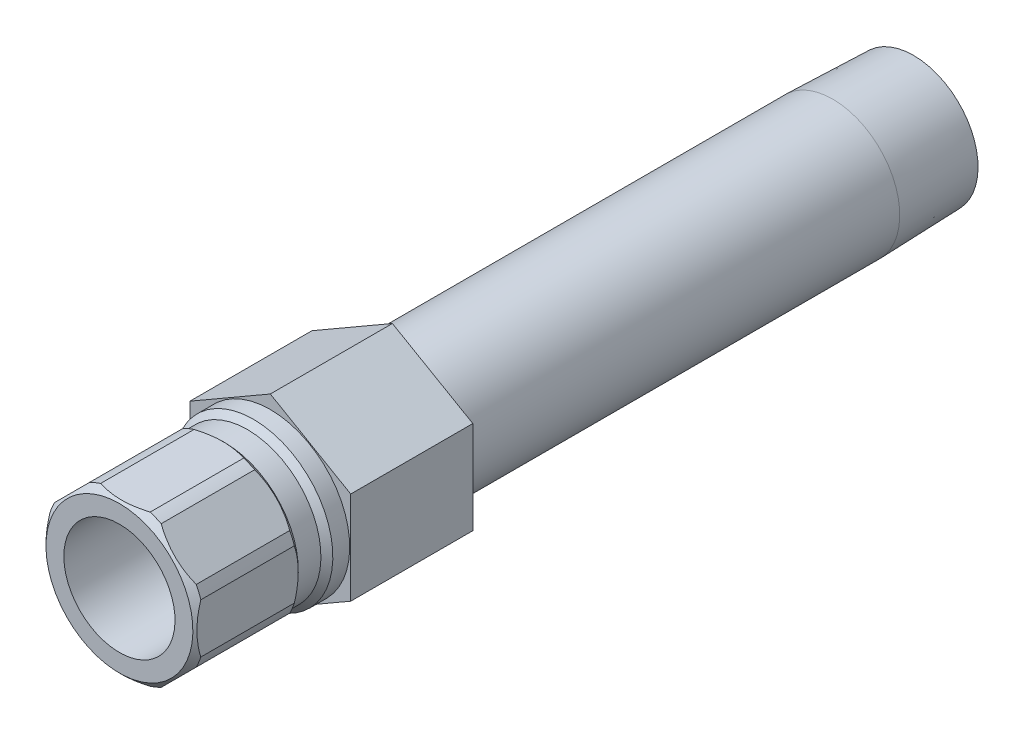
from build123d import *

# Parameters (mm, degrees)
SKETCH2_R           = 6.2611
BOSS_EXTRUDE1_DEPTH = 15.621
CUT_EXTRUDE1_START  = 5.8166
SKETCH3_OUTSIDE_W   = 43.844
SKETCH3_OUTSIDE_H   = 47.026
CUT_EXTRUDE1_DEPTH  = 78.966157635


with BuildPart() as part:
    # Sketch1 → Revolve1 (revolve)
    with BuildSketch(Plane(origin=(0, 0, 0), x_dir=(0, 0, -1), z_dir=(1, 0, 0))):
        Polygon((-19.304, 7.112), (-19.304, 9.398), (-18.542, 10.16), (-6.5786, 10.16), (-5.8166, 9.398), (-2.921, 9.398), (-2.159, 10.16), (0, 10.16), (0, 8.5725), (71.9582, 8.5725), (82.296, 8.249445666), (82.296, 6.2611), (-0.6731, 6.2611), (-1.524, 7.112), align=None)
    revolve(axis=Axis((0, 0, 0), (0, 0, 1)))

    # Sketch2 → Boss-Extrude1 (add)
    with BuildSketch(Plane.XY):
        Polygon((-10.287, 5.939202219), (-10.287, -5.939202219), (0, -11.878404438), (10.287, -5.939202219), (10.287, 5.939202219), (0, 11.878404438), align=None)
        with Locations(Location((0, 0, 0), (0, 0, 90))):
            Circle(SKETCH2_R, mode=Mode.SUBTRACT)
    extrude(amount=-BOSS_EXTRUDE1_DEPTH)

    # Sketch3 outside → Cut-Extrude1 (cut, through all)
    with BuildSketch(Plane.XY.offset(CUT_EXTRUDE1_START)):
        Rectangle(SKETCH3_OUTSIDE_W, SKETCH3_OUTSIDE_H)
        Polygon((9.652, -3.997989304), (9.652, 3.997989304), (3.997989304, 9.652), (-3.997989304, 9.652), (-9.652, 3.997989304), (-9.652, -3.997989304), (-3.997989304, -9.652), (3.997989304, -9.652), align=None, mode=Mode.SUBTRACT)
    extrude(amount=CUT_EXTRUDE1_DEPTH, mode=Mode.SUBTRACT)


solid = part.part
